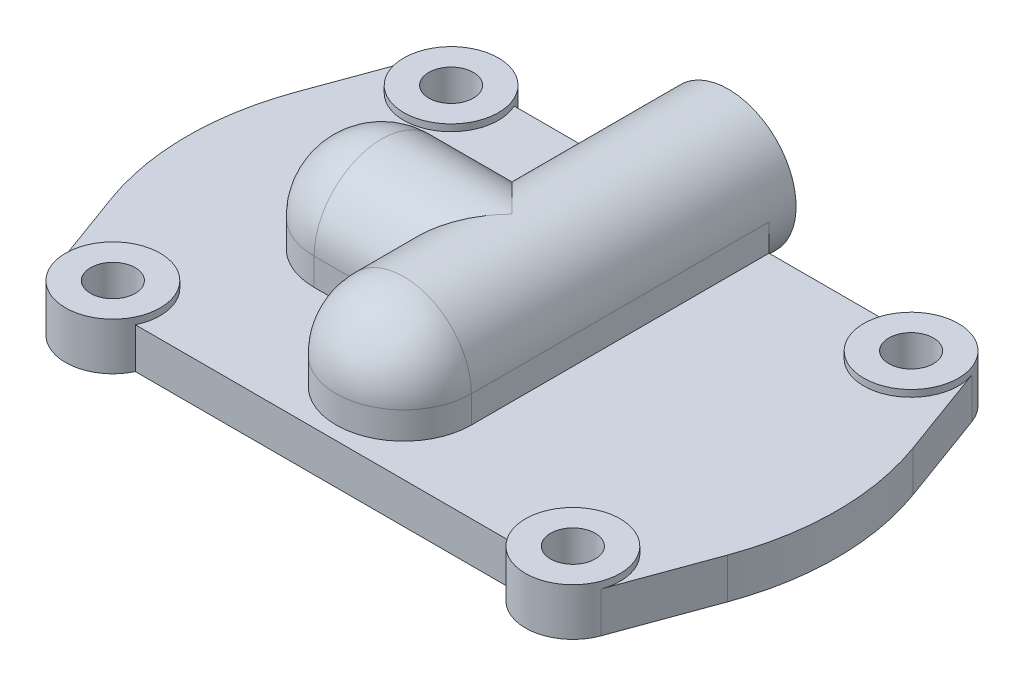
ISO-10303-21;
HEADER;
FILE_DESCRIPTION(('STEP AP214'),'2;1');
FILE_NAME('part.step','',(''),(''),'','','');
FILE_SCHEMA(('AUTOMOTIVE_DESIGN { 1 0 10303 214 1 1 1 1 }'));
ENDSEC;
DATA;
#1=APPLICATION_CONTEXT('core data for automotive mechanical design processes');
#2=APPLICATION_PROTOCOL_DEFINITION('international standard','automotive_design',2000,#1);
#3=PRODUCT_CONTEXT('',#1,'mechanical');
#4=PRODUCT('Part','Part','',(#3));
#5=PRODUCT_RELATED_PRODUCT_CATEGORY('part','',(#4));
#6=PRODUCT_DEFINITION_FORMATION('','',#4);
#7=PRODUCT_DEFINITION_CONTEXT('part definition',#1,'design');
#8=PRODUCT_DEFINITION('design','',#6,#7);
#9=PRODUCT_DEFINITION_SHAPE('','',#8);
#10=(LENGTH_UNIT() NAMED_UNIT(*) SI_UNIT(.MILLI.,.METRE.));
#11=(NAMED_UNIT(*) PLANE_ANGLE_UNIT() SI_UNIT($,.RADIAN.));
#12=(NAMED_UNIT(*) SI_UNIT($,.STERADIAN.) SOLID_ANGLE_UNIT());
#13=UNCERTAINTY_MEASURE_WITH_UNIT(LENGTH_MEASURE(1.E-05),#10,'distance_accuracy_value','');
#14=(GEOMETRIC_REPRESENTATION_CONTEXT(3) GLOBAL_UNCERTAINTY_ASSIGNED_CONTEXT((#13)) GLOBAL_UNIT_ASSIGNED_CONTEXT((#10,
#11,#12)) REPRESENTATION_CONTEXT('',''));
#15=CARTESIAN_POINT('',(0.,0.,0.));
#16=DIRECTION('',(0.,0.,1.));
#17=DIRECTION('',(1.,0.,0.));
#18=AXIS2_PLACEMENT_3D('',#15,#16,#17);
#19=CARTESIAN_POINT('',(-34.,0.,-25.));
#20=DIRECTION('',(0.,1.,0.));
#21=DIRECTION('',(0.,0.,1.));
#22=AXIS2_PLACEMENT_3D('',#19,#20,#21);
#23=PLANE('',#22);
#24=CARTESIAN_POINT('',(0.,0.,-16.));
#25=DIRECTION('',(0.,-1.,0.));
#26=DIRECTION('',(0.,0.,-1.));
#27=AXIS2_PLACEMENT_3D('',#24,#25,#26);
#28=CIRCLE('',#27,2.);
#29=CARTESIAN_POINT('',(0.,0.,-18.));
#30=VERTEX_POINT('',#29);
#31=EDGE_CURVE('E748',#30,#30,#28,.T.);
#32=ORIENTED_EDGE('',*,*,#31,.F.);
#33=EDGE_LOOP('',(#32));
#34=FACE_BOUND('',#33,.T.);
#35=CARTESIAN_POINT('',(-19.25,0.,0.));
#36=DIRECTION('',(0.,-1.,0.));
#37=DIRECTION('',(0.,0.,-1.));
#38=AXIS2_PLACEMENT_3D('',#35,#36,#37);
#39=CIRCLE('',#38,8.);
#40=CARTESIAN_POINT('',(-19.25,0.,-8.));
#41=VERTEX_POINT('',#40);
#42=EDGE_CURVE('E403',#41,#41,#39,.T.);
#43=ORIENTED_EDGE('',*,*,#42,.F.);
#44=EDGE_LOOP('',(#43));
#45=FACE_BOUND('',#44,.T.);
#46=CARTESIAN_POINT('',(34.,0.,25.));
#47=DIRECTION('',(0.,1.,0.));
#48=DIRECTION('',(0.,0.,-1.));
#49=AXIS2_PLACEMENT_3D('',#46,#47,#48);
#50=CIRCLE('',#49,3.3);
#51=CARTESIAN_POINT('',(34.,0.,21.7));
#52=VERTEX_POINT('',#51);
#53=EDGE_CURVE('E540',#52,#52,#50,.T.);
#54=ORIENTED_EDGE('',*,*,#53,.T.);
#55=EDGE_LOOP('',(#54));
#56=FACE_BOUND('',#55,.T.);
#57=CARTESIAN_POINT('',(-34.,0.,25.));
#58=DIRECTION('',(0.,1.,0.));
#59=DIRECTION('',(0.,0.,1.));
#60=AXIS2_PLACEMENT_3D('',#57,#58,#59);
#61=CIRCLE('',#60,3.3);
#62=CARTESIAN_POINT('',(-34.,0.,28.3));
#63=VERTEX_POINT('',#62);
#64=EDGE_CURVE('E546',#63,#63,#61,.T.);
#65=ORIENTED_EDGE('',*,*,#64,.T.);
#66=EDGE_LOOP('',(#65));
#67=FACE_BOUND('',#66,.T.);
#68=CARTESIAN_POINT('',(-34.,0.,-25.));
#69=DIRECTION('',(0.,1.,0.));
#70=DIRECTION('',(0.,0.,1.));
#71=AXIS2_PLACEMENT_3D('',#68,#69,#70);
#72=CIRCLE('',#71,7.);
#73=CARTESIAN_POINT('',(-27.6754446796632,0.,-28.));
#74=VERTEX_POINT('',#73);
#75=CARTESIAN_POINT('',(-40.5749719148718,0.,-27.4020292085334));
#76=VERTEX_POINT('',#75);
#77=EDGE_CURVE('E290',#74,#76,#72,.T.);
#78=ORIENTED_EDGE('',*,*,#77,.F.);
#79=DIRECTION('',(-1.,0.,0.));
#80=VECTOR('',#79,1.);
#81=CARTESIAN_POINT('',(-27.6754446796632,0.,-28.));
#82=LINE('',#81,#80);
#83=CARTESIAN_POINT('',(0.,-1.52655665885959E-13,-28.));
#84=VERTEX_POINT('',#83);
#85=EDGE_CURVE('E319',#84,#74,#82,.T.);
#86=ORIENTED_EDGE('',*,*,#85,.F.);
#87=CARTESIAN_POINT('',(27.6754446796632,0.,-28.));
#88=VERTEX_POINT('',#87);
#89=EDGE_CURVE('E320',#88,#84,#82,.T.);
#90=ORIENTED_EDGE('',*,*,#89,.F.);
#91=CARTESIAN_POINT('',(34.,0.,-25.));
#92=DIRECTION('',(0.,1.,0.));
#93=DIRECTION('',(0.,0.,-1.));
#94=AXIS2_PLACEMENT_3D('',#91,#92,#93);
#95=CIRCLE('',#94,7.);
#96=CARTESIAN_POINT('',(40.5749719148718,0.,-27.4020292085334));
#97=VERTEX_POINT('',#96);
#98=EDGE_CURVE('E317',#97,#88,#95,.T.);
#99=ORIENTED_EDGE('',*,*,#98,.F.);
#100=DIRECTION('',(-0.343147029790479,0.,-0.939281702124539));
#101=VECTOR('',#100,1.);
#102=CARTESIAN_POINT('',(40.5749719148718,0.,-27.4020292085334));
#103=LINE('',#102,#101);
#104=CARTESIAN_POINT('',(45.5712680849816,0.,-13.7258811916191));
#105=VERTEX_POINT('',#104);
#106=EDGE_CURVE('E315',#105,#97,#103,.T.);
#107=ORIENTED_EDGE('',*,*,#106,.F.);
#108=CARTESIAN_POINT('',(8.,0.,0.));
#109=DIRECTION('',(0.,1.,0.));
#110=DIRECTION('',(0.,0.,1.));
#111=AXIS2_PLACEMENT_3D('',#108,#109,#110);
#112=CIRCLE('',#111,40.);
#113=CARTESIAN_POINT('',(45.5712680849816,0.,13.7258811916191));
#114=VERTEX_POINT('',#113);
#115=EDGE_CURVE('E313',#114,#105,#112,.T.);
#116=ORIENTED_EDGE('',*,*,#115,.F.);
#117=DIRECTION('',(0.343147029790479,0.,-0.939281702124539));
#118=VECTOR('',#117,1.);
#119=CARTESIAN_POINT('',(40.5749719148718,0.,27.4020292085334));
#120=LINE('',#119,#118);
#121=CARTESIAN_POINT('',(40.5749719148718,0.,27.4020292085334));
#122=VERTEX_POINT('',#121);
#123=EDGE_CURVE('E311',#122,#114,#120,.T.);
#124=ORIENTED_EDGE('',*,*,#123,.F.);
#125=CARTESIAN_POINT('',(34.,0.,25.));
#126=DIRECTION('',(0.,1.,0.));
#127=DIRECTION('',(0.,0.,1.));
#128=AXIS2_PLACEMENT_3D('',#125,#126,#127);
#129=CIRCLE('',#128,6.99999999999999);
#130=CARTESIAN_POINT('',(27.6754446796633,0.,28.));
#131=VERTEX_POINT('',#130);
#132=EDGE_CURVE('E309',#131,#122,#129,.T.);
#133=ORIENTED_EDGE('',*,*,#132,.F.);
#134=DIRECTION('',(1.,0.,0.));
#135=VECTOR('',#134,1.);
#136=CARTESIAN_POINT('',(-27.6754446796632,0.,28.));
#137=LINE('',#136,#135);
#138=CARTESIAN_POINT('',(-27.6754446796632,0.,28.));
#139=VERTEX_POINT('',#138);
#140=EDGE_CURVE('E307',#139,#131,#137,.T.);
#141=ORIENTED_EDGE('',*,*,#140,.F.);
#142=CARTESIAN_POINT('',(-34.,0.,25.));
#143=DIRECTION('',(0.,1.,0.));
#144=DIRECTION('',(0.,0.,-1.));
#145=AXIS2_PLACEMENT_3D('',#142,#143,#144);
#146=CIRCLE('',#145,7.);
#147=CARTESIAN_POINT('',(-40.5749719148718,0.,27.4020292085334));
#148=VERTEX_POINT('',#147);
#149=EDGE_CURVE('E302',#148,#139,#146,.T.);
#150=ORIENTED_EDGE('',*,*,#149,.F.);
#151=DIRECTION('',(0.343147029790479,0.,0.939281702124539));
#152=VECTOR('',#151,1.);
#153=CARTESIAN_POINT('',(-40.5749719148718,0.,27.4020292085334));
#154=LINE('',#153,#152);
#155=CARTESIAN_POINT('',(-45.5712680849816,0.,13.7258811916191));
#156=VERTEX_POINT('',#155);
#157=EDGE_CURVE('E300',#156,#148,#154,.T.);
#158=ORIENTED_EDGE('',*,*,#157,.F.);
#159=CARTESIAN_POINT('',(-8.,0.,0.));
#160=DIRECTION('',(0.,1.,0.));
#161=DIRECTION('',(0.,0.,1.));
#162=AXIS2_PLACEMENT_3D('',#159,#160,#161);
#163=CIRCLE('',#162,40.);
#164=CARTESIAN_POINT('',(-45.5712680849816,0.,-13.7258811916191));
#165=VERTEX_POINT('',#164);
#166=EDGE_CURVE('E289',#165,#156,#163,.T.);
#167=ORIENTED_EDGE('',*,*,#166,.F.);
#168=DIRECTION('',(-0.343147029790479,0.,0.939281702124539));
#169=VECTOR('',#168,1.);
#170=CARTESIAN_POINT('',(-40.5749719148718,0.,-27.4020292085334));
#171=LINE('',#170,#169);
#172=EDGE_CURVE('E278',#76,#165,#171,.T.);
#173=ORIENTED_EDGE('',*,*,#172,.F.);
#174=EDGE_LOOP('',(#78,#86,#90,#99,#107,#116,#124,#133,#141,#150,#158,#167,#173));
#175=FACE_BOUND('',#174,.T.);
#176=CARTESIAN_POINT('',(-34.,0.,-25.));
#177=DIRECTION('',(0.,1.,0.));
#178=DIRECTION('',(0.,0.,-1.));
#179=AXIS2_PLACEMENT_3D('',#176,#177,#178);
#180=CIRCLE('',#179,3.3);
#181=CARTESIAN_POINT('',(-34.,0.,-28.3));
#182=VERTEX_POINT('',#181);
#183=EDGE_CURVE('E543',#182,#182,#180,.T.);
#184=ORIENTED_EDGE('',*,*,#183,.T.);
#185=EDGE_LOOP('',(#184));
#186=FACE_BOUND('',#185,.T.);
#187=CARTESIAN_POINT('',(34.,0.,-25.));
#188=DIRECTION('',(0.,1.,0.));
#189=DIRECTION('',(0.,0.,1.));
#190=AXIS2_PLACEMENT_3D('',#187,#188,#189);
#191=CIRCLE('',#190,3.3);
#192=CARTESIAN_POINT('',(34.,0.,-21.7));
#193=VERTEX_POINT('',#192);
#194=EDGE_CURVE('E537',#193,#193,#191,.T.);
#195=ORIENTED_EDGE('',*,*,#194,.T.);
#196=EDGE_LOOP('',(#195));
#197=FACE_BOUND('',#196,.T.);
#198=CARTESIAN_POINT('',(0.,0.,16.));
#199=DIRECTION('',(0.,-1.,0.));
#200=DIRECTION('',(0.,0.,-1.));
#201=AXIS2_PLACEMENT_3D('',#198,#199,#200);
#202=CIRCLE('',#201,1.99999999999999);
#203=CARTESIAN_POINT('',(0.,0.,14.));
#204=VERTEX_POINT('',#203);
#205=EDGE_CURVE('E707',#204,#204,#202,.T.);
#206=ORIENTED_EDGE('',*,*,#205,.F.);
#207=EDGE_LOOP('',(#206));
#208=FACE_BOUND('',#207,.T.);
#209=ADVANCED_FACE('F27',(#34,#45,#56,#67,#175,#186,#197,#208),#23,.F.);
#210=CARTESIAN_POINT('',(0.,10.,-33.5692116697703));
#211=DIRECTION('',(0.,0.,-1.));
#212=DIRECTION('',(0.,1.,0.));
#213=AXIS2_PLACEMENT_3D('',#210,#211,#212);
#214=CYLINDRICAL_SURFACE('',#213,2.);
#215=CARTESIAN_POINT('',(0.,9.99999999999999,-5.58058436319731));
#216=DIRECTION('',(0.,0.,-1.));
#217=DIRECTION('',(0.,1.,0.));
#218=AXIS2_PLACEMENT_3D('',#215,#216,#217);
#219=CIRCLE('',#218,2.);
#220=CARTESIAN_POINT('',(0.,12.,-5.58058436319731));
#221=VERTEX_POINT('',#220);
#222=EDGE_CURVE('E423',#221,#221,#219,.T.);
#223=ORIENTED_EDGE('',*,*,#222,.T.);
#224=EDGE_LOOP('',(#223));
#225=FACE_BOUND('',#224,.T.);
#226=CARTESIAN_POINT('',(0.,9.99999999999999,16.));
#227=DIRECTION('',(0.,-0.707106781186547,-0.707106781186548));
#228=DIRECTION('',(0.,0.707106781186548,-0.707106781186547));
#229=AXIS2_PLACEMENT_3D('',#226,#227,#228);
#230=ELLIPSE('',#229,2.82842712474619,2.);
#231=CARTESIAN_POINT('',(-1.63299316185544,11.1547005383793,14.8452994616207));
#232=VERTEX_POINT('',#231);
#233=CARTESIAN_POINT('',(1.63299316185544,11.1547005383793,14.8452994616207));
#234=VERTEX_POINT('',#233);
#235=EDGE_CURVE('E412',#232,#234,#230,.T.);
#236=ORIENTED_EDGE('',*,*,#235,.F.);
#237=CARTESIAN_POINT('',(0.,9.99999999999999,14.8452994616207));
#238=DIRECTION('',(0.,0.,-1.));
#239=DIRECTION('',(0.,1.,0.));
#240=AXIS2_PLACEMENT_3D('',#237,#238,#239);
#241=CIRCLE('',#240,2.);
#242=CARTESIAN_POINT('',(-1.63299316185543,8.84529946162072,14.8452994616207));
#243=VERTEX_POINT('',#242);
#244=EDGE_CURVE('E407',#243,#232,#241,.T.);
#245=ORIENTED_EDGE('',*,*,#244,.F.);
#246=CARTESIAN_POINT('',(0.,9.99999999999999,16.));
#247=DIRECTION('',(0.,0.707106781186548,-0.707106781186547));
#248=DIRECTION('',(0.,-0.707106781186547,-0.707106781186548));
#249=AXIS2_PLACEMENT_3D('',#246,#247,#248);
#250=ELLIPSE('',#249,2.82842712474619,2.);
#251=CARTESIAN_POINT('',(1.63299316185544,8.84529946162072,14.8452994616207));
#252=VERTEX_POINT('',#251);
#253=EDGE_CURVE('E46',#252,#243,#250,.T.);
#254=ORIENTED_EDGE('',*,*,#253,.F.);
#255=EDGE_CURVE('E410',#234,#252,#241,.T.);
#256=ORIENTED_EDGE('',*,*,#255,.F.);
#257=EDGE_LOOP('',(#236,#245,#254,#256));
#258=FACE_BOUND('',#257,.T.);
#259=ADVANCED_FACE('F207',(#225,#258),#214,.F.);
#260=CARTESIAN_POINT('',(0.,9.99999999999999,14.8452994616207));
#261=DIRECTION('',(0.,0.,-1.));
#262=DIRECTION('',(0.,1.,0.));
#263=AXIS2_PLACEMENT_3D('',#260,#261,#262);
#264=CONICAL_SURFACE('',#263,2.,1.04719755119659);
#265=CARTESIAN_POINT('',(1.63285172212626,11.155500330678,14.8450994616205));
#266=CARTESIAN_POINT('',(1.65205657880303,11.046865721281,14.8722945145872));
#267=CARTESIAN_POINT('',(1.668461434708,10.9369789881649,14.8968959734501));
#268=CARTESIAN_POINT('',(1.6957223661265,10.7150106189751,14.9392492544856));
#269=CARTESIAN_POINT('',(1.70656780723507,10.602925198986,14.9569879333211));
#270=CARTESIAN_POINT('',(1.72246461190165,10.3804150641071,14.9834642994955));
#271=CARTESIAN_POINT('',(1.72766829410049,10.2700304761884,14.9924379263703));
#272=CARTESIAN_POINT('',(1.73276151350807,10.048877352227,15.0012157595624));
#273=CARTESIAN_POINT('',(1.73265685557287,9.93810936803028,15.0010299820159));
#274=CARTESIAN_POINT('',(1.72784997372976,9.74510943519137,14.9927546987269));
#275=CARTESIAN_POINT('',(1.72431830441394,9.66275199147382,14.9866778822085));
#276=CARTESIAN_POINT('',(1.71431393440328,9.4986579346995,14.9698426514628));
#277=CARTESIAN_POINT('',(1.7078397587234,9.41692165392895,14.9590818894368));
#278=CARTESIAN_POINT('',(1.69179162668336,9.25265386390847,14.9331926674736));
#279=CARTESIAN_POINT('',(1.68215423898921,9.17014282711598,14.9179755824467));
#280=CARTESIAN_POINT('',(1.65980970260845,9.00636926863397,14.8840078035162));
#281=CARTESIAN_POINT('',(1.6471061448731,8.92510540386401,14.8652612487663));
#282=CARTESIAN_POINT('',(1.63285172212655,8.84449966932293,14.8450994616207));
#283=B_SPLINE_CURVE_WITH_KNOTS('',3,(#265,#266,#267,#268,#269,#270,#271,#272,#273,#274,#275,
#276,#277,#278,#279,#280,#281,#282),.UNSPECIFIED.,.F.,.F.,(4,2,2,2,2,2,2,2,4),(0.,
0.340954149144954,0.682558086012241,1.01469010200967,1.34645892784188,1.59424234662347,
1.84215010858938,2.09536844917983,2.34829165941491),.UNSPECIFIED.);
#284=EDGE_CURVE('E11',#234,#252,#283,.T.);
#285=ORIENTED_EDGE('',*,*,#284,.F.);
#286=ORIENTED_EDGE('',*,*,#255,.T.);
#287=EDGE_LOOP('',(#285,#286));
#288=FACE_BOUND('',#287,.T.);
#289=ADVANCED_FACE('F214',(#288),#264,.F.);
#290=CARTESIAN_POINT('',(-1.63285172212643,8.84449966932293,14.8450994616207));
#291=CARTESIAN_POINT('',(-1.65205657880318,8.95313427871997,14.8722945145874));
#292=CARTESIAN_POINT('',(-1.66846143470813,9.06302101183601,14.8968959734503));
#293=CARTESIAN_POINT('',(-1.69572236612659,9.28498938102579,14.9392492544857));
#294=CARTESIAN_POINT('',(-1.70656780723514,9.39707480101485,14.9569879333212));
#295=CARTESIAN_POINT('',(-1.7224646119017,9.61958493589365,14.9834642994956));
#296=CARTESIAN_POINT('',(-1.72766829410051,9.72996952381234,14.9924379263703));
#297=CARTESIAN_POINT('',(-1.73276151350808,9.95112264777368,15.0012157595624));
#298=CARTESIAN_POINT('',(-1.73265685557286,10.0618906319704,15.0010299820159));
#299=CARTESIAN_POINT('',(-1.72784997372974,10.2548905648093,14.9927546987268));
#300=CARTESIAN_POINT('',(-1.7243183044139,10.3372480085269,14.9866778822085));
#301=CARTESIAN_POINT('',(-1.71431393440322,10.5013420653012,14.9698426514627));
#302=CARTESIAN_POINT('',(-1.70783975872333,10.5830783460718,14.9590818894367));
#303=CARTESIAN_POINT('',(-1.69179162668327,10.7473461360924,14.9331926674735));
#304=CARTESIAN_POINT('',(-1.6821542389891,10.8298571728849,14.9179755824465));
#305=CARTESIAN_POINT('',(-1.65980970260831,10.9936307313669,14.884007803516));
#306=CARTESIAN_POINT('',(-1.64710614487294,11.0748945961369,14.8652612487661));
#307=CARTESIAN_POINT('',(-1.63285172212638,11.155500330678,14.8450994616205));
#308=B_SPLINE_CURVE_WITH_KNOTS('',3,(#290,#291,#292,#293,#294,#295,#296,#297,#298,#299,#300,
#301,#302,#303,#304,#305,#306,#307),.UNSPECIFIED.,.F.,.F.,(4,2,2,2,2,2,2,2,4),(0.,
0.340954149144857,0.682558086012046,1.01469010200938,1.3464589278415,1.59424234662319,
1.84215010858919,2.09536844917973,2.34829165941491),.UNSPECIFIED.);
#309=EDGE_CURVE('E40',#243,#232,#308,.T.);
#310=ORIENTED_EDGE('',*,*,#309,.F.);
#311=ORIENTED_EDGE('',*,*,#244,.T.);
#312=EDGE_LOOP('',(#310,#311));
#313=FACE_BOUND('',#312,.T.);
#314=ADVANCED_FACE('F615',(#313),#264,.F.);
#315=CARTESIAN_POINT('',(0.,9.99999999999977,-50.3606797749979));
#316=DIRECTION('',(0.,0.,1.));
#317=DIRECTION('',(0.,-1.,0.));
#318=AXIS2_PLACEMENT_3D('',#315,#316,#317);
#319=CYLINDRICAL_SURFACE('',#318,10.);
#320=CARTESIAN_POINT('',(0.,9.99999999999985,-32.));
#321=DIRECTION('',(0.,0.,-1.));
#322=DIRECTION('',(-1.,0.,0.));
#323=AXIS2_PLACEMENT_3D('',#320,#321,#322);
#324=CIRCLE('',#323,10.);
#325=CARTESIAN_POINT('',(-10.,9.99999999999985,-32.));
#326=VERTEX_POINT('',#325);
#327=EDGE_CURVE('E435',#326,#326,#324,.T.);
#328=ORIENTED_EDGE('',*,*,#327,.F.);
#329=EDGE_LOOP('',(#328));
#330=FACE_BOUND('',#329,.T.);
#331=CARTESIAN_POINT('',(0.,9.99999999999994,0.));
#332=DIRECTION('',(-0.707106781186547,0.,0.707106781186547));
#333=DIRECTION('',(-0.707106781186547,0.,-0.707106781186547));
#334=AXIS2_PLACEMENT_3D('',#331,#332,#333);
#335=ELLIPSE('',#334,14.142135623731,10.);
#336=CARTESIAN_POINT('',(-10.,10.,-10.));
#337=VERTEX_POINT('',#336);
#338=CARTESIAN_POINT('',(0.,19.9999999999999,0.));
#339=VERTEX_POINT('',#338);
#340=EDGE_CURVE('E54',#337,#339,#335,.F.);
#341=ORIENTED_EDGE('',*,*,#340,.T.);
#342=CARTESIAN_POINT('',(0.,9.99999999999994,0.));
#343=DIRECTION('',(-0.707106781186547,0.,-0.707106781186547));
#344=DIRECTION('',(-0.707106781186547,0.,0.707106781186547));
#345=AXIS2_PLACEMENT_3D('',#342,#343,#344);
#346=ELLIPSE('',#345,14.142135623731,10.);
#347=CARTESIAN_POINT('',(-10.,10.,9.99999999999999));
#348=VERTEX_POINT('',#347);
#349=EDGE_CURVE('E427',#339,#348,#346,.F.);
#350=ORIENTED_EDGE('',*,*,#349,.T.);
#351=DIRECTION('',(0.,0.,1.));
#352=VECTOR('',#351,1.);
#353=CARTESIAN_POINT('',(-10.,10.,9.99999999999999));
#354=LINE('',#353,#352);
#355=CARTESIAN_POINT('',(-10.,10.,16.));
#356=VERTEX_POINT('',#355);
#357=EDGE_CURVE('E472',#348,#356,#354,.T.);
#358=ORIENTED_EDGE('',*,*,#357,.T.);
#359=CARTESIAN_POINT('',(0.,10.,16.));
#360=DIRECTION('',(0.,0.,-1.));
#361=DIRECTION('',(0.,1.,0.));
#362=AXIS2_PLACEMENT_3D('',#359,#360,#361);
#363=CIRCLE('',#362,10.);
#364=CARTESIAN_POINT('',(10.,10.,16.));
#365=VERTEX_POINT('',#364);
#366=EDGE_CURVE('E438',#356,#365,#363,.T.);
#367=ORIENTED_EDGE('',*,*,#366,.T.);
#368=DIRECTION('',(0.,0.,-1.));
#369=VECTOR('',#368,1.);
#370=CARTESIAN_POINT('',(10.,10.,-28.));
#371=LINE('',#370,#369);
#372=CARTESIAN_POINT('',(10.,10.,-28.));
#373=VERTEX_POINT('',#372);
#374=EDGE_CURVE('E477',#365,#373,#371,.T.);
#375=ORIENTED_EDGE('',*,*,#374,.T.);
#376=CARTESIAN_POINT('',(0.,9.99999999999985,-28.));
#377=DIRECTION('',(0.,0.,-1.));
#378=DIRECTION('',(-1.,0.,0.));
#379=AXIS2_PLACEMENT_3D('',#376,#377,#378);
#380=CIRCLE('',#379,10.);
#381=EDGE_CURVE('E434',#373,#84,#380,.T.);
#382=ORIENTED_EDGE('',*,*,#381,.T.);
#383=CARTESIAN_POINT('',(-10.,10.,-28.));
#384=VERTEX_POINT('',#383);
#385=EDGE_CURVE('E432',#84,#384,#380,.T.);
#386=ORIENTED_EDGE('',*,*,#385,.T.);
#387=DIRECTION('',(0.,0.,1.));
#388=VECTOR('',#387,1.);
#389=CARTESIAN_POINT('',(-10.,10.,-28.));
#390=LINE('',#389,#388);
#391=EDGE_CURVE('E462',#384,#337,#390,.T.);
#392=ORIENTED_EDGE('',*,*,#391,.T.);
#393=EDGE_LOOP('',(#341,#350,#358,#367,#375,#382,#386,#392));
#394=FACE_BOUND('',#393,.T.);
#395=ADVANCED_FACE('F231',(#330,#394),#319,.T.);
#396=CARTESIAN_POINT('',(-27.6754446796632,6.,-28.));
#397=DIRECTION('',(0.,0.,1.));
#398=DIRECTION('',(1.,0.,0.));
#399=AXIS2_PLACEMENT_3D('',#396,#397,#398);
#400=PLANE('',#399);
#401=ORIENTED_EDGE('',*,*,#381,.F.);
#402=DIRECTION('',(0.,-1.,0.));
#403=VECTOR('',#402,1.);
#404=CARTESIAN_POINT('',(10.,10.,-28.));
#405=LINE('',#404,#403);
#406=CARTESIAN_POINT('',(10.,6.,-28.));
#407=VERTEX_POINT('',#406);
#408=EDGE_CURVE('E480',#373,#407,#405,.T.);
#409=ORIENTED_EDGE('',*,*,#408,.T.);
#410=DIRECTION('',(-1.,0.,0.));
#411=VECTOR('',#410,1.);
#412=CARTESIAN_POINT('',(-27.6754446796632,6.,-28.));
#413=LINE('',#412,#411);
#414=CARTESIAN_POINT('',(27.6754446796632,6.,-28.));
#415=VERTEX_POINT('',#414);
#416=EDGE_CURVE('E378',#415,#407,#413,.T.);
#417=ORIENTED_EDGE('',*,*,#416,.F.);
#418=DIRECTION('',(0.,-1.,0.));
#419=VECTOR('',#418,1.);
#420=CARTESIAN_POINT('',(27.6754446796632,6.,-28.));
#421=LINE('',#420,#419);
#422=EDGE_CURVE('E336',#415,#88,#421,.T.);
#423=ORIENTED_EDGE('',*,*,#422,.T.);
#424=ORIENTED_EDGE('',*,*,#89,.T.);
#425=EDGE_LOOP('',(#401,#409,#417,#423,#424));
#426=FACE_BOUND('',#425,.T.);
#427=ADVANCED_FACE('F228',(#426),#400,.F.);
#428=ORIENTED_EDGE('',*,*,#385,.F.);
#429=ORIENTED_EDGE('',*,*,#85,.T.);
#430=DIRECTION('',(0.,-1.,0.));
#431=VECTOR('',#430,1.);
#432=CARTESIAN_POINT('',(-27.6754446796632,6.,-28.));
#433=LINE('',#432,#431);
#434=CARTESIAN_POINT('',(-27.6754446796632,6.,-28.));
#435=VERTEX_POINT('',#434);
#436=EDGE_CURVE('E340',#435,#74,#433,.T.);
#437=ORIENTED_EDGE('',*,*,#436,.F.);
#438=CARTESIAN_POINT('',(-10.,6.,-28.));
#439=VERTEX_POINT('',#438);
#440=EDGE_CURVE('E335',#439,#435,#413,.T.);
#441=ORIENTED_EDGE('',*,*,#440,.F.);
#442=DIRECTION('',(0.,-1.,0.));
#443=VECTOR('',#442,1.);
#444=CARTESIAN_POINT('',(-10.,10.,-28.));
#445=LINE('',#444,#443);
#446=EDGE_CURVE('E501',#384,#439,#445,.T.);
#447=ORIENTED_EDGE('',*,*,#446,.F.);
#448=EDGE_LOOP('',(#428,#429,#437,#441,#447));
#449=FACE_BOUND('',#448,.T.);
#450=ADVANCED_FACE('F226',(#449),#400,.F.);
#451=CARTESIAN_POINT('',(-34.,6.,-25.));
#452=DIRECTION('',(0.,1.,0.));
#453=DIRECTION('',(0.,0.,1.));
#454=AXIS2_PLACEMENT_3D('',#451,#452,#453);
#455=PLANE('',#454);
#456=DIRECTION('',(-1.,0.,0.));
#457=VECTOR('',#456,1.);
#458=CARTESIAN_POINT('',(-10.,6.,-10.));
#459=LINE('',#458,#457);
#460=CARTESIAN_POINT('',(-10.,6.,-10.));
#461=VERTEX_POINT('',#460);
#462=CARTESIAN_POINT('',(-19.25,6.,-10.));
#463=VERTEX_POINT('',#462);
#464=EDGE_CURVE('E444',#461,#463,#459,.T.);
#465=ORIENTED_EDGE('',*,*,#464,.F.);
#466=DIRECTION('',(0.,0.,1.));
#467=VECTOR('',#466,1.);
#468=CARTESIAN_POINT('',(-10.,6.,-28.));
#469=LINE('',#468,#467);
#470=EDGE_CURVE('E441',#439,#461,#469,.T.);
#471=ORIENTED_EDGE('',*,*,#470,.F.);
#472=ORIENTED_EDGE('',*,*,#440,.T.);
#473=CARTESIAN_POINT('',(-34.,6.,-25.));
#474=DIRECTION('',(0.,1.,0.));
#475=DIRECTION('',(0.,0.,1.));
#476=AXIS2_PLACEMENT_3D('',#473,#474,#475);
#477=CIRCLE('',#476,7.);
#478=CARTESIAN_POINT('',(-40.5749719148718,6.,-27.4020292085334));
#479=VERTEX_POINT('',#478);
#480=EDGE_CURVE('E366',#479,#435,#477,.T.);
#481=ORIENTED_EDGE('',*,*,#480,.F.);
#482=DIRECTION('',(-0.343147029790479,0.,0.939281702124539));
#483=VECTOR('',#482,1.);
#484=CARTESIAN_POINT('',(-40.5749719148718,6.,-27.4020292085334));
#485=LINE('',#484,#483);
#486=CARTESIAN_POINT('',(-45.5712680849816,6.,-13.7258811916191));
#487=VERTEX_POINT('',#486);
#488=EDGE_CURVE('E323',#479,#487,#485,.T.);
#489=ORIENTED_EDGE('',*,*,#488,.T.);
#490=CARTESIAN_POINT('',(-8.,6.,0.));
#491=DIRECTION('',(0.,1.,0.));
#492=DIRECTION('',(0.,0.,1.));
#493=AXIS2_PLACEMENT_3D('',#490,#491,#492);
#494=CIRCLE('',#493,40.);
#495=CARTESIAN_POINT('',(-45.5712680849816,6.,13.7258811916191));
#496=VERTEX_POINT('',#495);
#497=EDGE_CURVE('E294',#487,#496,#494,.T.);
#498=ORIENTED_EDGE('',*,*,#497,.T.);
#499=DIRECTION('',(0.343147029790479,0.,0.939281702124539));
#500=VECTOR('',#499,1.);
#501=CARTESIAN_POINT('',(-40.5749719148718,6.,27.4020292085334));
#502=LINE('',#501,#500);
#503=CARTESIAN_POINT('',(-40.5749719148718,6.,27.4020292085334));
#504=VERTEX_POINT('',#503);
#505=EDGE_CURVE('E325',#496,#504,#502,.T.);
#506=ORIENTED_EDGE('',*,*,#505,.T.);
#507=CARTESIAN_POINT('',(-34.,6.,25.));
#508=DIRECTION('',(0.,1.,0.));
#509=DIRECTION('',(0.,0.,1.));
#510=AXIS2_PLACEMENT_3D('',#507,#508,#509);
#511=CIRCLE('',#510,7.);
#512=CARTESIAN_POINT('',(-27.6754446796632,6.,28.));
#513=VERTEX_POINT('',#512);
#514=EDGE_CURVE('E507',#513,#504,#511,.T.);
#515=ORIENTED_EDGE('',*,*,#514,.F.);
#516=DIRECTION('',(1.,0.,0.));
#517=VECTOR('',#516,1.);
#518=CARTESIAN_POINT('',(-27.6754446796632,6.,28.));
#519=LINE('',#518,#517);
#520=CARTESIAN_POINT('',(27.6754446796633,6.,28.));
#521=VERTEX_POINT('',#520);
#522=EDGE_CURVE('E327',#513,#521,#519,.T.);
#523=ORIENTED_EDGE('',*,*,#522,.T.);
#524=CARTESIAN_POINT('',(34.,6.,25.));
#525=DIRECTION('',(0.,1.,0.));
#526=DIRECTION('',(0.,0.,1.));
#527=AXIS2_PLACEMENT_3D('',#524,#525,#526);
#528=CIRCLE('',#527,6.99999999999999);
#529=CARTESIAN_POINT('',(40.5749719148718,6.,27.4020292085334));
#530=VERTEX_POINT('',#529);
#531=EDGE_CURVE('E516',#530,#521,#528,.T.);
#532=ORIENTED_EDGE('',*,*,#531,.F.);
#533=DIRECTION('',(0.343147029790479,0.,-0.939281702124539));
#534=VECTOR('',#533,1.);
#535=CARTESIAN_POINT('',(40.5749719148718,6.,27.4020292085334));
#536=LINE('',#535,#534);
#537=CARTESIAN_POINT('',(45.5712680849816,6.,13.7258811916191));
#538=VERTEX_POINT('',#537);
#539=EDGE_CURVE('E329',#530,#538,#536,.T.);
#540=ORIENTED_EDGE('',*,*,#539,.T.);
#541=CARTESIAN_POINT('',(8.,6.,0.));
#542=DIRECTION('',(0.,1.,0.));
#543=DIRECTION('',(0.,0.,1.));
#544=AXIS2_PLACEMENT_3D('',#541,#542,#543);
#545=CIRCLE('',#544,40.);
#546=CARTESIAN_POINT('',(45.5712680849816,6.,-13.7258811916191));
#547=VERTEX_POINT('',#546);
#548=EDGE_CURVE('E331',#538,#547,#545,.T.);
#549=ORIENTED_EDGE('',*,*,#548,.T.);
#550=DIRECTION('',(-0.343147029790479,0.,-0.939281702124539));
#551=VECTOR('',#550,1.);
#552=CARTESIAN_POINT('',(40.5749719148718,6.,-27.4020292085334));
#553=LINE('',#552,#551);
#554=CARTESIAN_POINT('',(40.5749719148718,6.,-27.4020292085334));
#555=VERTEX_POINT('',#554);
#556=EDGE_CURVE('E333',#547,#555,#553,.T.);
#557=ORIENTED_EDGE('',*,*,#556,.T.);
#558=CARTESIAN_POINT('',(34.,6.,-25.));
#559=DIRECTION('',(0.,1.,0.));
#560=DIRECTION('',(0.,0.,1.));
#561=AXIS2_PLACEMENT_3D('',#558,#559,#560);
#562=CIRCLE('',#561,7.);
#563=EDGE_CURVE('E525',#415,#555,#562,.T.);
#564=ORIENTED_EDGE('',*,*,#563,.F.);
#565=ORIENTED_EDGE('',*,*,#416,.T.);
#566=DIRECTION('',(0.,0.,-1.));
#567=VECTOR('',#566,1.);
#568=CARTESIAN_POINT('',(10.,6.,-28.));
#569=LINE('',#568,#567);
#570=CARTESIAN_POINT('',(10.,6.,16.));
#571=VERTEX_POINT('',#570);
#572=EDGE_CURVE('E459',#571,#407,#569,.T.);
#573=ORIENTED_EDGE('',*,*,#572,.F.);
#574=CARTESIAN_POINT('',(0.,6.,16.));
#575=DIRECTION('',(0.,1.,0.));
#576=DIRECTION('',(0.,0.,1.));
#577=AXIS2_PLACEMENT_3D('',#574,#575,#576);
#578=CIRCLE('',#577,10.);
#579=CARTESIAN_POINT('',(-10.,6.,16.));
#580=VERTEX_POINT('',#579);
#581=EDGE_CURVE('E456',#580,#571,#578,.T.);
#582=ORIENTED_EDGE('',*,*,#581,.F.);
#583=DIRECTION('',(0.,0.,1.));
#584=VECTOR('',#583,1.);
#585=CARTESIAN_POINT('',(-10.,6.,9.99999999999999));
#586=LINE('',#585,#584);
#587=CARTESIAN_POINT('',(-10.,6.,10.));
#588=VERTEX_POINT('',#587);
#589=EDGE_CURVE('E453',#588,#580,#586,.T.);
#590=ORIENTED_EDGE('',*,*,#589,.F.);
#591=DIRECTION('',(1.,0.,0.));
#592=VECTOR('',#591,1.);
#593=CARTESIAN_POINT('',(-10.,6.,9.99999999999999));
#594=LINE('',#593,#592);
#595=CARTESIAN_POINT('',(-19.25,6.,10.));
#596=VERTEX_POINT('',#595);
#597=EDGE_CURVE('E450',#596,#588,#594,.T.);
#598=ORIENTED_EDGE('',*,*,#597,.F.);
#599=CARTESIAN_POINT('',(-19.25,6.,0.));
#600=DIRECTION('',(0.,1.,0.));
#601=DIRECTION('',(0.,0.,1.));
#602=AXIS2_PLACEMENT_3D('',#599,#600,#601);
#603=CIRCLE('',#602,10.);
#604=EDGE_CURVE('E447',#463,#596,#603,.T.);
#605=ORIENTED_EDGE('',*,*,#604,.F.);
#606=EDGE_LOOP('',(#465,#471,#472,#481,#489,#498,#506,#515,#523,#532,#540,#549,#557,#564,#565,
#573,#582,#590,#598,#605));
#607=FACE_BOUND('',#606,.T.);
#608=ADVANCED_FACE('F223',(#607),#455,.T.);
#609=CARTESIAN_POINT('',(-34.,6.,-25.));
#610=DIRECTION('',(0.,-1.,0.));
#611=DIRECTION('',(0.,0.,-1.));
#612=AXIS2_PLACEMENT_3D('',#609,#610,#611);
#613=CYLINDRICAL_SURFACE('',#612,7.);
#614=ORIENTED_EDGE('',*,*,#77,.T.);
#615=DIRECTION('',(0.,-1.,0.));
#616=VECTOR('',#615,1.);
#617=CARTESIAN_POINT('',(-40.5749719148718,6.,-27.4020292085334));
#618=LINE('',#617,#616);
#619=EDGE_CURVE('E284',#479,#76,#618,.T.);
#620=ORIENTED_EDGE('',*,*,#619,.F.);
#621=ORIENTED_EDGE('',*,*,#480,.T.);
#622=ORIENTED_EDGE('',*,*,#436,.T.);
#623=EDGE_LOOP('',(#614,#620,#621,#622));
#624=FACE_BOUND('',#623,.T.);
#625=CARTESIAN_POINT('',(-34.,7.,-25.));
#626=DIRECTION('',(0.,1.,0.));
#627=DIRECTION('',(0.,0.,1.));
#628=AXIS2_PLACEMENT_3D('',#625,#626,#627);
#629=CIRCLE('',#628,7.);
#630=CARTESIAN_POINT('',(-34.,7.,-18.));
#631=VERTEX_POINT('',#630);
#632=EDGE_CURVE('E534',#631,#631,#629,.T.);
#633=ORIENTED_EDGE('',*,*,#632,.F.);
#634=EDGE_LOOP('',(#633));
#635=FACE_BOUND('',#634,.T.);
#636=ADVANCED_FACE('F29',(#624,#635),#613,.T.);
#637=CARTESIAN_POINT('',(-40.5749719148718,6.,-27.4020292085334));
#638=DIRECTION('',(0.939281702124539,0.,0.343147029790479));
#639=DIRECTION('',(0.343147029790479,0.,-0.93928170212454));
#640=AXIS2_PLACEMENT_3D('',#637,#638,#639);
#641=PLANE('',#640);
#642=ORIENTED_EDGE('',*,*,#172,.T.);
#643=DIRECTION('',(0.,-1.,0.));
#644=VECTOR('',#643,1.);
#645=CARTESIAN_POINT('',(-45.5712680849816,6.,-13.7258811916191));
#646=LINE('',#645,#644);
#647=EDGE_CURVE('E281',#487,#165,#646,.T.);
#648=ORIENTED_EDGE('',*,*,#647,.F.);
#649=ORIENTED_EDGE('',*,*,#488,.F.);
#650=ORIENTED_EDGE('',*,*,#619,.T.);
#651=EDGE_LOOP('',(#642,#648,#649,#650));
#652=FACE_BOUND('',#651,.T.);
#653=ADVANCED_FACE('F267',(#652),#641,.F.);
#654=CARTESIAN_POINT('',(-8.,6.,0.));
#655=DIRECTION('',(0.,-1.,0.));
#656=DIRECTION('',(0.,0.,-1.));
#657=AXIS2_PLACEMENT_3D('',#654,#655,#656);
#658=CYLINDRICAL_SURFACE('',#657,40.);
#659=ORIENTED_EDGE('',*,*,#166,.T.);
#660=DIRECTION('',(0.,-1.,0.));
#661=VECTOR('',#660,1.);
#662=CARTESIAN_POINT('',(-45.5712680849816,6.,13.7258811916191));
#663=LINE('',#662,#661);
#664=EDGE_CURVE('E295',#496,#156,#663,.T.);
#665=ORIENTED_EDGE('',*,*,#664,.F.);
#666=ORIENTED_EDGE('',*,*,#497,.F.);
#667=ORIENTED_EDGE('',*,*,#647,.T.);
#668=EDGE_LOOP('',(#659,#665,#666,#667));
#669=FACE_BOUND('',#668,.T.);
#670=ADVANCED_FACE('F264',(#669),#658,.T.);
#671=CARTESIAN_POINT('',(-40.5749719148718,6.,27.4020292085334));
#672=DIRECTION('',(0.939281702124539,0.,-0.343147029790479));
#673=DIRECTION('',(-0.343147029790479,0.,-0.93928170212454));
#674=AXIS2_PLACEMENT_3D('',#671,#672,#673);
#675=PLANE('',#674);
#676=ORIENTED_EDGE('',*,*,#157,.T.);
#677=DIRECTION('',(0.,-1.,0.));
#678=VECTOR('',#677,1.);
#679=CARTESIAN_POINT('',(-40.5749719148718,6.,27.4020292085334));
#680=LINE('',#679,#678);
#681=EDGE_CURVE('E358',#504,#148,#680,.T.);
#682=ORIENTED_EDGE('',*,*,#681,.F.);
#683=ORIENTED_EDGE('',*,*,#505,.F.);
#684=ORIENTED_EDGE('',*,*,#664,.T.);
#685=EDGE_LOOP('',(#676,#682,#683,#684));
#686=FACE_BOUND('',#685,.T.);
#687=ADVANCED_FACE('F260',(#686),#675,.F.);
#688=CARTESIAN_POINT('',(-34.,6.,25.));
#689=DIRECTION('',(0.,-1.,0.));
#690=DIRECTION('',(0.,0.,-1.));
#691=AXIS2_PLACEMENT_3D('',#688,#689,#690);
#692=CYLINDRICAL_SURFACE('',#691,7.);
#693=ORIENTED_EDGE('',*,*,#149,.T.);
#694=DIRECTION('',(0.,-1.,0.));
#695=VECTOR('',#694,1.);
#696=CARTESIAN_POINT('',(-27.6754446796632,6.,28.));
#697=LINE('',#696,#695);
#698=EDGE_CURVE('E355',#513,#139,#697,.T.);
#699=ORIENTED_EDGE('',*,*,#698,.F.);
#700=ORIENTED_EDGE('',*,*,#514,.T.);
#701=ORIENTED_EDGE('',*,*,#681,.T.);
#702=EDGE_LOOP('',(#693,#699,#700,#701));
#703=FACE_BOUND('',#702,.T.);
#704=CARTESIAN_POINT('',(-34.,7.,25.));
#705=DIRECTION('',(0.,1.,0.));
#706=DIRECTION('',(0.,0.,1.));
#707=AXIS2_PLACEMENT_3D('',#704,#705,#706);
#708=CIRCLE('',#707,7.);
#709=CARTESIAN_POINT('',(-34.,7.,32.));
#710=VERTEX_POINT('',#709);
#711=EDGE_CURVE('E510',#710,#710,#708,.T.);
#712=ORIENTED_EDGE('',*,*,#711,.F.);
#713=EDGE_LOOP('',(#712));
#714=FACE_BOUND('',#713,.T.);
#715=ADVANCED_FACE('F256',(#703,#714),#692,.T.);
#716=CARTESIAN_POINT('',(-27.6754446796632,6.,28.));
#717=DIRECTION('',(0.,0.,-1.));
#718=DIRECTION('',(-1.,0.,0.));
#719=AXIS2_PLACEMENT_3D('',#716,#717,#718);
#720=PLANE('',#719);
#721=ORIENTED_EDGE('',*,*,#140,.T.);
#722=DIRECTION('',(0.,-1.,0.));
#723=VECTOR('',#722,1.);
#724=CARTESIAN_POINT('',(27.6754446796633,6.,28.));
#725=LINE('',#724,#723);
#726=EDGE_CURVE('E352',#521,#131,#725,.T.);
#727=ORIENTED_EDGE('',*,*,#726,.F.);
#728=ORIENTED_EDGE('',*,*,#522,.F.);
#729=ORIENTED_EDGE('',*,*,#698,.T.);
#730=EDGE_LOOP('',(#721,#727,#728,#729));
#731=FACE_BOUND('',#730,.T.);
#732=ADVANCED_FACE('F252',(#731),#720,.F.);
#733=CARTESIAN_POINT('',(34.,6.,25.));
#734=DIRECTION('',(0.,-1.,0.));
#735=DIRECTION('',(0.,0.,-1.));
#736=AXIS2_PLACEMENT_3D('',#733,#734,#735);
#737=CYLINDRICAL_SURFACE('',#736,6.99999999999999);
#738=ORIENTED_EDGE('',*,*,#132,.T.);
#739=DIRECTION('',(0.,-1.,0.));
#740=VECTOR('',#739,1.);
#741=CARTESIAN_POINT('',(40.5749719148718,6.,27.4020292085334));
#742=LINE('',#741,#740);
#743=EDGE_CURVE('E349',#530,#122,#742,.T.);
#744=ORIENTED_EDGE('',*,*,#743,.F.);
#745=ORIENTED_EDGE('',*,*,#531,.T.);
#746=ORIENTED_EDGE('',*,*,#726,.T.);
#747=EDGE_LOOP('',(#738,#744,#745,#746));
#748=FACE_BOUND('',#747,.T.);
#749=CARTESIAN_POINT('',(34.,7.,25.));
#750=DIRECTION('',(0.,1.,0.));
#751=DIRECTION('',(0.,0.,1.));
#752=AXIS2_PLACEMENT_3D('',#749,#750,#751);
#753=CIRCLE('',#752,6.99999999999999);
#754=CARTESIAN_POINT('',(34.,7.,32.));
#755=VERTEX_POINT('',#754);
#756=EDGE_CURVE('E519',#755,#755,#753,.T.);
#757=ORIENTED_EDGE('',*,*,#756,.F.);
#758=EDGE_LOOP('',(#757));
#759=FACE_BOUND('',#758,.T.);
#760=ADVANCED_FACE('F248',(#748,#759),#737,.T.);
#761=CARTESIAN_POINT('',(40.5749719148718,6.,27.4020292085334));
#762=DIRECTION('',(-0.939281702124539,0.,-0.343147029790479));
#763=DIRECTION('',(-0.343147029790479,0.,0.93928170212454));
#764=AXIS2_PLACEMENT_3D('',#761,#762,#763);
#765=PLANE('',#764);
#766=ORIENTED_EDGE('',*,*,#123,.T.);
#767=DIRECTION('',(0.,-1.,0.));
#768=VECTOR('',#767,1.);
#769=CARTESIAN_POINT('',(45.5712680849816,6.,13.7258811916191));
#770=LINE('',#769,#768);
#771=EDGE_CURVE('E346',#538,#114,#770,.T.);
#772=ORIENTED_EDGE('',*,*,#771,.F.);
#773=ORIENTED_EDGE('',*,*,#539,.F.);
#774=ORIENTED_EDGE('',*,*,#743,.T.);
#775=EDGE_LOOP('',(#766,#772,#773,#774));
#776=FACE_BOUND('',#775,.T.);
#777=ADVANCED_FACE('F244',(#776),#765,.F.);
#778=CARTESIAN_POINT('',(8.,6.,0.));
#779=DIRECTION('',(0.,-1.,0.));
#780=DIRECTION('',(0.,0.,-1.));
#781=AXIS2_PLACEMENT_3D('',#778,#779,#780);
#782=CYLINDRICAL_SURFACE('',#781,40.);
#783=ORIENTED_EDGE('',*,*,#115,.T.);
#784=DIRECTION('',(0.,-1.,0.));
#785=VECTOR('',#784,1.);
#786=CARTESIAN_POINT('',(45.5712680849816,6.,-13.7258811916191));
#787=LINE('',#786,#785);
#788=EDGE_CURVE('E343',#547,#105,#787,.T.);
#789=ORIENTED_EDGE('',*,*,#788,.F.);
#790=ORIENTED_EDGE('',*,*,#548,.F.);
#791=ORIENTED_EDGE('',*,*,#771,.T.);
#792=EDGE_LOOP('',(#783,#789,#790,#791));
#793=FACE_BOUND('',#792,.T.);
#794=ADVANCED_FACE('F240',(#793),#782,.T.);
#795=CARTESIAN_POINT('',(40.5749719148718,6.,-27.4020292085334));
#796=DIRECTION('',(-0.939281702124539,0.,0.343147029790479));
#797=DIRECTION('',(0.343147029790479,0.,0.93928170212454));
#798=AXIS2_PLACEMENT_3D('',#795,#796,#797);
#799=PLANE('',#798);
#800=ORIENTED_EDGE('',*,*,#106,.T.);
#801=DIRECTION('',(0.,-1.,0.));
#802=VECTOR('',#801,1.);
#803=CARTESIAN_POINT('',(40.5749719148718,6.,-27.4020292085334));
#804=LINE('',#803,#802);
#805=EDGE_CURVE('E339',#555,#97,#804,.T.);
#806=ORIENTED_EDGE('',*,*,#805,.F.);
#807=ORIENTED_EDGE('',*,*,#556,.F.);
#808=ORIENTED_EDGE('',*,*,#788,.T.);
#809=EDGE_LOOP('',(#800,#806,#807,#808));
#810=FACE_BOUND('',#809,.T.);
#811=ADVANCED_FACE('F236',(#810),#799,.F.);
#812=CARTESIAN_POINT('',(34.,6.,-25.));
#813=DIRECTION('',(0.,-1.,0.));
#814=DIRECTION('',(0.,0.,-1.));
#815=AXIS2_PLACEMENT_3D('',#812,#813,#814);
#816=CYLINDRICAL_SURFACE('',#815,7.);
#817=ORIENTED_EDGE('',*,*,#98,.T.);
#818=ORIENTED_EDGE('',*,*,#422,.F.);
#819=ORIENTED_EDGE('',*,*,#563,.T.);
#820=ORIENTED_EDGE('',*,*,#805,.T.);
#821=EDGE_LOOP('',(#817,#818,#819,#820));
#822=FACE_BOUND('',#821,.T.);
#823=CARTESIAN_POINT('',(34.,7.,-25.));
#824=DIRECTION('',(0.,1.,0.));
#825=DIRECTION('',(0.,0.,1.));
#826=AXIS2_PLACEMENT_3D('',#823,#824,#825);
#827=CIRCLE('',#826,7.);
#828=CARTESIAN_POINT('',(34.,7.,-18.));
#829=VERTEX_POINT('',#828);
#830=EDGE_CURVE('E528',#829,#829,#827,.T.);
#831=ORIENTED_EDGE('',*,*,#830,.F.);
#832=EDGE_LOOP('',(#831));
#833=FACE_BOUND('',#832,.T.);
#834=ADVANCED_FACE('F233',(#822,#833),#816,.T.);
#835=CARTESIAN_POINT('',(-34.,6.,25.));
#836=DIRECTION('',(0.,-1.,0.));
#837=DIRECTION('',(0.,0.,-1.));
#838=AXIS2_PLACEMENT_3D('',#835,#836,#837);
#839=CYLINDRICAL_SURFACE('',#838,3.3);
#840=ORIENTED_EDGE('',*,*,#64,.F.);
#841=EDGE_LOOP('',(#840));
#842=FACE_BOUND('',#841,.T.);
#843=CARTESIAN_POINT('',(-34.,7.,25.));
#844=DIRECTION('',(0.,1.,0.));
#845=DIRECTION('',(0.,0.,1.));
#846=AXIS2_PLACEMENT_3D('',#843,#844,#845);
#847=CIRCLE('',#846,3.3);
#848=CARTESIAN_POINT('',(-34.,7.,28.3));
#849=VERTEX_POINT('',#848);
#850=EDGE_CURVE('E504',#849,#849,#847,.T.);
#851=ORIENTED_EDGE('',*,*,#850,.T.);
#852=EDGE_LOOP('',(#851));
#853=FACE_BOUND('',#852,.T.);
#854=ADVANCED_FACE('F221',(#842,#853),#839,.F.);
#855=CARTESIAN_POINT('',(-34.,6.,-25.));
#856=DIRECTION('',(0.,-1.,0.));
#857=DIRECTION('',(0.,0.,-1.));
#858=AXIS2_PLACEMENT_3D('',#855,#856,#857);
#859=CYLINDRICAL_SURFACE('',#858,3.3);
#860=ORIENTED_EDGE('',*,*,#183,.F.);
#861=EDGE_LOOP('',(#860));
#862=FACE_BOUND('',#861,.T.);
#863=CARTESIAN_POINT('',(-34.,7.,-25.));
#864=DIRECTION('',(0.,1.,0.));
#865=DIRECTION('',(0.,0.,1.));
#866=AXIS2_PLACEMENT_3D('',#863,#864,#865);
#867=CIRCLE('',#866,3.3);
#868=CARTESIAN_POINT('',(-34.,7.,-21.7));
#869=VERTEX_POINT('',#868);
#870=EDGE_CURVE('E531',#869,#869,#867,.T.);
#871=ORIENTED_EDGE('',*,*,#870,.T.);
#872=EDGE_LOOP('',(#871));
#873=FACE_BOUND('',#872,.T.);
#874=ADVANCED_FACE('F689',(#862,#873),#859,.F.);
#875=CARTESIAN_POINT('',(34.,6.,25.));
#876=DIRECTION('',(0.,-1.,0.));
#877=DIRECTION('',(0.,0.,-1.));
#878=AXIS2_PLACEMENT_3D('',#875,#876,#877);
#879=CYLINDRICAL_SURFACE('',#878,3.3);
#880=ORIENTED_EDGE('',*,*,#53,.F.);
#881=EDGE_LOOP('',(#880));
#882=FACE_BOUND('',#881,.T.);
#883=CARTESIAN_POINT('',(34.,7.,25.));
#884=DIRECTION('',(0.,1.,0.));
#885=DIRECTION('',(0.,0.,1.));
#886=AXIS2_PLACEMENT_3D('',#883,#884,#885);
#887=CIRCLE('',#886,3.3);
#888=CARTESIAN_POINT('',(34.,7.,28.3));
#889=VERTEX_POINT('',#888);
#890=EDGE_CURVE('E513',#889,#889,#887,.T.);
#891=ORIENTED_EDGE('',*,*,#890,.T.);
#892=EDGE_LOOP('',(#891));
#893=FACE_BOUND('',#892,.T.);
#894=ADVANCED_FACE('F686',(#882,#893),#879,.F.);
#895=CARTESIAN_POINT('',(34.,6.,-25.));
#896=DIRECTION('',(0.,-1.,0.));
#897=DIRECTION('',(0.,0.,-1.));
#898=AXIS2_PLACEMENT_3D('',#895,#896,#897);
#899=CYLINDRICAL_SURFACE('',#898,3.3);
#900=ORIENTED_EDGE('',*,*,#194,.F.);
#901=EDGE_LOOP('',(#900));
#902=FACE_BOUND('',#901,.T.);
#903=CARTESIAN_POINT('',(34.,7.,-25.));
#904=DIRECTION('',(0.,1.,0.));
#905=DIRECTION('',(0.,0.,1.));
#906=AXIS2_PLACEMENT_3D('',#903,#904,#905);
#907=CIRCLE('',#906,3.3);
#908=CARTESIAN_POINT('',(34.,7.,-21.7));
#909=VERTEX_POINT('',#908);
#910=EDGE_CURVE('E522',#909,#909,#907,.T.);
#911=ORIENTED_EDGE('',*,*,#910,.T.);
#912=EDGE_LOOP('',(#911));
#913=FACE_BOUND('',#912,.T.);
#914=ADVANCED_FACE('F682',(#902,#913),#899,.F.);
#915=CARTESIAN_POINT('',(-34.,7.,-25.));
#916=DIRECTION('',(0.,1.,0.));
#917=DIRECTION('',(0.,0.,1.));
#918=AXIS2_PLACEMENT_3D('',#915,#916,#917);
#919=PLANE('',#918);
#920=ORIENTED_EDGE('',*,*,#632,.T.);
#921=EDGE_LOOP('',(#920));
#922=FACE_BOUND('',#921,.T.);
#923=ORIENTED_EDGE('',*,*,#870,.F.);
#924=EDGE_LOOP('',(#923));
#925=FACE_BOUND('',#924,.T.);
#926=ADVANCED_FACE('F678',(#922,#925),#919,.T.);
#927=CARTESIAN_POINT('',(34.,7.,-25.));
#928=DIRECTION('',(0.,1.,0.));
#929=DIRECTION('',(0.,0.,1.));
#930=AXIS2_PLACEMENT_3D('',#927,#928,#929);
#931=PLANE('',#930);
#932=ORIENTED_EDGE('',*,*,#830,.T.);
#933=EDGE_LOOP('',(#932));
#934=FACE_BOUND('',#933,.T.);
#935=ORIENTED_EDGE('',*,*,#910,.F.);
#936=EDGE_LOOP('',(#935));
#937=FACE_BOUND('',#936,.T.);
#938=ADVANCED_FACE('F674',(#934,#937),#931,.T.);
#939=CARTESIAN_POINT('',(34.,7.,25.));
#940=DIRECTION('',(0.,1.,0.));
#941=DIRECTION('',(0.,0.,1.));
#942=AXIS2_PLACEMENT_3D('',#939,#940,#941);
#943=PLANE('',#942);
#944=ORIENTED_EDGE('',*,*,#756,.T.);
#945=EDGE_LOOP('',(#944));
#946=FACE_BOUND('',#945,.T.);
#947=ORIENTED_EDGE('',*,*,#890,.F.);
#948=EDGE_LOOP('',(#947));
#949=FACE_BOUND('',#948,.T.);
#950=ADVANCED_FACE('F670',(#946,#949),#943,.T.);
#951=CARTESIAN_POINT('',(-34.,7.,25.));
#952=DIRECTION('',(0.,1.,0.));
#953=DIRECTION('',(0.,0.,1.));
#954=AXIS2_PLACEMENT_3D('',#951,#952,#953);
#955=PLANE('',#954);
#956=ORIENTED_EDGE('',*,*,#711,.T.);
#957=EDGE_LOOP('',(#956));
#958=FACE_BOUND('',#957,.T.);
#959=ORIENTED_EDGE('',*,*,#850,.F.);
#960=EDGE_LOOP('',(#959));
#961=FACE_BOUND('',#960,.T.);
#962=ADVANCED_FACE('F666',(#958,#961),#955,.T.);
#963=CARTESIAN_POINT('',(-10.,10.,-28.));
#964=DIRECTION('',(1.,0.,0.));
#965=DIRECTION('',(0.,0.,-1.));
#966=AXIS2_PLACEMENT_3D('',#963,#964,#965);
#967=PLANE('',#966);
#968=ORIENTED_EDGE('',*,*,#470,.T.);
#969=DIRECTION('',(0.,-1.,0.));
#970=VECTOR('',#969,1.);
#971=CARTESIAN_POINT('',(-10.,10.,-10.));
#972=LINE('',#971,#970);
#973=EDGE_CURVE('E498',#337,#461,#972,.T.);
#974=ORIENTED_EDGE('',*,*,#973,.F.);
#975=ORIENTED_EDGE('',*,*,#391,.F.);
#976=ORIENTED_EDGE('',*,*,#446,.T.);
#977=EDGE_LOOP('',(#968,#974,#975,#976));
#978=FACE_BOUND('',#977,.T.);
#979=ADVANCED_FACE('F662',(#978),#967,.F.);
#980=CARTESIAN_POINT('',(-10.,10.,-10.));
#981=DIRECTION('',(0.,0.,1.));
#982=DIRECTION('',(1.,0.,0.));
#983=AXIS2_PLACEMENT_3D('',#980,#981,#982);
#984=PLANE('',#983);
#985=ORIENTED_EDGE('',*,*,#464,.T.);
#986=DIRECTION('',(0.,-1.,0.));
#987=VECTOR('',#986,1.);
#988=CARTESIAN_POINT('',(-19.25,10.,-10.));
#989=LINE('',#988,#987);
#990=CARTESIAN_POINT('',(-19.25,10.,-10.));
#991=VERTEX_POINT('',#990);
#992=EDGE_CURVE('E495',#991,#463,#989,.T.);
#993=ORIENTED_EDGE('',*,*,#992,.F.);
#994=DIRECTION('',(-1.,0.,0.));
#995=VECTOR('',#994,1.);
#996=CARTESIAN_POINT('',(-10.,10.,-10.));
#997=LINE('',#996,#995);
#998=EDGE_CURVE('E464',#337,#991,#997,.T.);
#999=ORIENTED_EDGE('',*,*,#998,.F.);
#1000=ORIENTED_EDGE('',*,*,#973,.T.);
#1001=EDGE_LOOP('',(#985,#993,#999,#1000));
#1002=FACE_BOUND('',#1001,.T.);
#1003=ADVANCED_FACE('F658',(#1002),#984,.F.);
#1004=CARTESIAN_POINT('',(-19.25,10.,0.));
#1005=DIRECTION('',(0.,-1.,0.));
#1006=DIRECTION('',(0.,0.,-1.));
#1007=AXIS2_PLACEMENT_3D('',#1004,#1005,#1006);
#1008=CYLINDRICAL_SURFACE('',#1007,10.);
#1009=ORIENTED_EDGE('',*,*,#604,.T.);
#1010=DIRECTION('',(0.,-1.,0.));
#1011=VECTOR('',#1010,1.);
#1012=CARTESIAN_POINT('',(-19.25,10.,9.99999999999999));
#1013=LINE('',#1012,#1011);
#1014=CARTESIAN_POINT('',(-19.25,10.,9.99999999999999));
#1015=VERTEX_POINT('',#1014);
#1016=EDGE_CURVE('E492',#1015,#596,#1013,.T.);
#1017=ORIENTED_EDGE('',*,*,#1016,.F.);
#1018=CARTESIAN_POINT('',(-19.25,10.,0.));
#1019=DIRECTION('',(0.,1.,0.));
#1020=DIRECTION('',(0.,0.,1.));
#1021=AXIS2_PLACEMENT_3D('',#1018,#1019,#1020);
#1022=CIRCLE('',#1021,10.);
#1023=EDGE_CURVE('E467',#991,#1015,#1022,.T.);
#1024=ORIENTED_EDGE('',*,*,#1023,.F.);
#1025=ORIENTED_EDGE('',*,*,#992,.T.);
#1026=EDGE_LOOP('',(#1009,#1017,#1024,#1025));
#1027=FACE_BOUND('',#1026,.T.);
#1028=ADVANCED_FACE('F654',(#1027),#1008,.T.);
#1029=CARTESIAN_POINT('',(-10.,10.,9.99999999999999));
#1030=DIRECTION('',(0.,0.,-1.));
#1031=DIRECTION('',(-1.,0.,0.));
#1032=AXIS2_PLACEMENT_3D('',#1029,#1030,#1031);
#1033=PLANE('',#1032);
#1034=ORIENTED_EDGE('',*,*,#597,.T.);
#1035=DIRECTION('',(0.,-1.,0.));
#1036=VECTOR('',#1035,1.);
#1037=CARTESIAN_POINT('',(-10.,10.,9.99999999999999));
#1038=LINE('',#1037,#1036);
#1039=EDGE_CURVE('E489',#348,#588,#1038,.T.);
#1040=ORIENTED_EDGE('',*,*,#1039,.F.);
#1041=DIRECTION('',(1.,0.,0.));
#1042=VECTOR('',#1041,1.);
#1043=CARTESIAN_POINT('',(-10.,10.,9.99999999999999));
#1044=LINE('',#1043,#1042);
#1045=EDGE_CURVE('E469',#1015,#348,#1044,.T.);
#1046=ORIENTED_EDGE('',*,*,#1045,.F.);
#1047=ORIENTED_EDGE('',*,*,#1016,.T.);
#1048=EDGE_LOOP('',(#1034,#1040,#1046,#1047));
#1049=FACE_BOUND('',#1048,.T.);
#1050=ADVANCED_FACE('F650',(#1049),#1033,.F.);
#1051=CARTESIAN_POINT('',(-10.,10.,9.99999999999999));
#1052=DIRECTION('',(1.,0.,0.));
#1053=DIRECTION('',(0.,0.,-1.));
#1054=AXIS2_PLACEMENT_3D('',#1051,#1052,#1053);
#1055=PLANE('',#1054);
#1056=ORIENTED_EDGE('',*,*,#589,.T.);
#1057=DIRECTION('',(0.,-1.,0.));
#1058=VECTOR('',#1057,1.);
#1059=CARTESIAN_POINT('',(-10.,10.,16.));
#1060=LINE('',#1059,#1058);
#1061=EDGE_CURVE('E486',#356,#580,#1060,.T.);
#1062=ORIENTED_EDGE('',*,*,#1061,.F.);
#1063=ORIENTED_EDGE('',*,*,#357,.F.);
#1064=ORIENTED_EDGE('',*,*,#1039,.T.);
#1065=EDGE_LOOP('',(#1056,#1062,#1063,#1064));
#1066=FACE_BOUND('',#1065,.T.);
#1067=ADVANCED_FACE('F646',(#1066),#1055,.F.);
#1068=CARTESIAN_POINT('',(0.,10.,16.));
#1069=DIRECTION('',(0.,-1.,0.));
#1070=DIRECTION('',(0.,0.,-1.));
#1071=AXIS2_PLACEMENT_3D('',#1068,#1069,#1070);
#1072=CYLINDRICAL_SURFACE('',#1071,10.);
#1073=ORIENTED_EDGE('',*,*,#581,.T.);
#1074=DIRECTION('',(0.,-1.,0.));
#1075=VECTOR('',#1074,1.);
#1076=CARTESIAN_POINT('',(10.,10.,16.));
#1077=LINE('',#1076,#1075);
#1078=EDGE_CURVE('E483',#365,#571,#1077,.T.);
#1079=ORIENTED_EDGE('',*,*,#1078,.F.);
#1080=CARTESIAN_POINT('',(0.,10.,16.));
#1081=DIRECTION('',(0.,1.,0.));
#1082=DIRECTION('',(0.,0.,1.));
#1083=AXIS2_PLACEMENT_3D('',#1080,#1081,#1082);
#1084=CIRCLE('',#1083,10.);
#1085=EDGE_CURVE('E475',#356,#365,#1084,.T.);
#1086=ORIENTED_EDGE('',*,*,#1085,.F.);
#1087=ORIENTED_EDGE('',*,*,#1061,.T.);
#1088=EDGE_LOOP('',(#1073,#1079,#1086,#1087));
#1089=FACE_BOUND('',#1088,.T.);
#1090=ADVANCED_FACE('F642',(#1089),#1072,.T.);
#1091=CARTESIAN_POINT('',(10.,10.,-28.));
#1092=DIRECTION('',(-1.,0.,0.));
#1093=DIRECTION('',(0.,0.,1.));
#1094=AXIS2_PLACEMENT_3D('',#1091,#1092,#1093);
#1095=PLANE('',#1094);
#1096=ORIENTED_EDGE('',*,*,#572,.T.);
#1097=ORIENTED_EDGE('',*,*,#408,.F.);
#1098=ORIENTED_EDGE('',*,*,#374,.F.);
#1099=ORIENTED_EDGE('',*,*,#1078,.T.);
#1100=EDGE_LOOP('',(#1096,#1097,#1098,#1099));
#1101=FACE_BOUND('',#1100,.T.);
#1102=ADVANCED_FACE('F638',(#1101),#1095,.F.);
#1103=CARTESIAN_POINT('',(0.,10.,16.));
#1104=DIRECTION('',(1.,0.,0.));
#1105=DIRECTION('',(0.,-1.,0.));
#1106=AXIS2_PLACEMENT_3D('',#1103,#1104,#1105);
#1107=SPHERICAL_SURFACE('',#1106,10.);
#1108=ORIENTED_EDGE('',*,*,#1085,.T.);
#1109=ORIENTED_EDGE('',*,*,#366,.F.);
#1110=EDGE_LOOP('',(#1108,#1109));
#1111=FACE_BOUND('',#1110,.T.);
#1112=ADVANCED_FACE('F603',(#1111),#1107,.T.);
#1113=CARTESIAN_POINT('',(0.,9.99999999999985,-32.));
#1114=DIRECTION('',(0.,0.,-1.));
#1115=DIRECTION('',(-1.,0.,0.));
#1116=AXIS2_PLACEMENT_3D('',#1113,#1114,#1115);
#1117=PLANE('',#1116);
#1118=CARTESIAN_POINT('',(0.,10.,-32.));
#1119=DIRECTION('',(0.,0.,-1.));
#1120=DIRECTION('',(0.,1.,0.));
#1121=AXIS2_PLACEMENT_3D('',#1118,#1119,#1120);
#1122=CIRCLE('',#1121,4.4585);
#1123=CARTESIAN_POINT('',(0.,14.4585,-32.));
#1124=VERTEX_POINT('',#1123);
#1125=EDGE_CURVE('E417',#1124,#1124,#1122,.T.);
#1126=ORIENTED_EDGE('',*,*,#1125,.F.);
#1127=EDGE_LOOP('',(#1126));
#1128=FACE_BOUND('',#1127,.T.);
#1129=ORIENTED_EDGE('',*,*,#327,.T.);
#1130=EDGE_LOOP('',(#1129));
#1131=FACE_BOUND('',#1130,.T.);
#1132=ADVANCED_FACE('F598',(#1128,#1131),#1117,.T.);
#1133=CARTESIAN_POINT('',(-19.25,10.,0.));
#1134=DIRECTION('',(0.,0.,1.));
#1135=DIRECTION('',(0.,1.,0.));
#1136=AXIS2_PLACEMENT_3D('',#1133,#1134,#1135);
#1137=SPHERICAL_SURFACE('',#1136,10.);
#1138=ORIENTED_EDGE('',*,*,#1023,.T.);
#1139=CARTESIAN_POINT('',(-19.25,10.,0.));
#1140=DIRECTION('',(1.,0.,0.));
#1141=DIRECTION('',(0.,0.,1.));
#1142=AXIS2_PLACEMENT_3D('',#1139,#1140,#1141);
#1143=CIRCLE('',#1142,10.);
#1144=EDGE_CURVE('E429',#991,#1015,#1143,.T.);
#1145=ORIENTED_EDGE('',*,*,#1144,.F.);
#1146=EDGE_LOOP('',(#1138,#1145));
#1147=FACE_BOUND('',#1146,.T.);
#1148=ADVANCED_FACE('F602',(#1147),#1137,.T.);
#1149=CARTESIAN_POINT('',(48.001,9.99999999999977,0.));
#1150=DIRECTION('',(-1.,0.,0.));
#1151=DIRECTION('',(0.,-1.,0.));
#1152=AXIS2_PLACEMENT_3D('',#1149,#1150,#1151);
#1153=CYLINDRICAL_SURFACE('',#1152,10.);
#1154=ORIENTED_EDGE('',*,*,#340,.F.);
#1155=ORIENTED_EDGE('',*,*,#998,.T.);
#1156=ORIENTED_EDGE('',*,*,#1144,.T.);
#1157=ORIENTED_EDGE('',*,*,#1045,.T.);
#1158=ORIENTED_EDGE('',*,*,#349,.F.);
#1159=EDGE_LOOP('',(#1154,#1155,#1156,#1157,#1158));
#1160=FACE_BOUND('',#1159,.T.);
#1161=ADVANCED_FACE('F609',(#1160),#1153,.T.);
#1162=CARTESIAN_POINT('',(0.,9.99999999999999,-7.));
#1163=DIRECTION('',(0.,0.,-1.));
#1164=DIRECTION('',(0.,1.,0.));
#1165=AXIS2_PLACEMENT_3D('',#1162,#1163,#1164);
#1166=CONICAL_SURFACE('',#1165,4.4585,1.0471975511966);
#1167=ORIENTED_EDGE('',*,*,#222,.F.);
#1168=EDGE_LOOP('',(#1167));
#1169=FACE_BOUND('',#1168,.T.);
#1170=CARTESIAN_POINT('',(0.,9.99999999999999,-7.));
#1171=DIRECTION('',(0.,0.,-1.));
#1172=DIRECTION('',(0.,1.,0.));
#1173=AXIS2_PLACEMENT_3D('',#1170,#1171,#1172);
#1174=CIRCLE('',#1173,4.4585);
#1175=CARTESIAN_POINT('',(0.,14.4585,-7.));
#1176=VERTEX_POINT('',#1175);
#1177=EDGE_CURVE('E420',#1176,#1176,#1174,.T.);
#1178=ORIENTED_EDGE('',*,*,#1177,.T.);
#1179=EDGE_LOOP('',(#1178));
#1180=FACE_BOUND('',#1179,.T.);
#1181=ADVANCED_FACE('F398',(#1169,#1180),#1166,.F.);
#1182=CARTESIAN_POINT('',(0.,10.,-33.5692116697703));
#1183=DIRECTION('',(0.,0.,-1.));
#1184=DIRECTION('',(0.,1.,0.));
#1185=AXIS2_PLACEMENT_3D('',#1182,#1183,#1184);
#1186=CYLINDRICAL_SURFACE('',#1185,4.4585);
#1187=CARTESIAN_POINT('',(0.,5.5415,-18.));
#1188=CARTESIAN_POINT('',(-0.106395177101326,5.54150423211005,-17.9999948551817));
#1189=CARTESIAN_POINT('',(-0.21295391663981,5.54535088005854,-17.9914600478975));
#1190=CARTESIAN_POINT('',(-0.422999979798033,5.56035590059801,-17.9576617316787));
#1191=CARTESIAN_POINT('',(-0.526479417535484,5.57153159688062,-17.9323585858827));
#1192=CARTESIAN_POINT('',(-0.726996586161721,5.60000947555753,-17.8661671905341));
#1193=CARTESIAN_POINT('',(-0.824056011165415,5.61728962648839,-17.8253349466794));
#1194=CARTESIAN_POINT('',(-1.009837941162,5.65632956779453,-17.7294973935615));
#1195=CARTESIAN_POINT('',(-1.09856224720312,5.67808838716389,-17.6744951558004));
#1196=CARTESIAN_POINT('',(-1.27030771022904,5.7253213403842,-17.5486219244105));
#1197=CARTESIAN_POINT('',(-1.35279946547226,5.75092913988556,-17.4770793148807));
#1198=CARTESIAN_POINT('',(-1.50508215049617,5.80245013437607,-17.3215833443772));
#1199=CARTESIAN_POINT('',(-1.57486536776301,5.8283635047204,-17.2376225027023));
#1200=CARTESIAN_POINT('',(-1.70384850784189,5.87929419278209,-17.0536819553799));
#1201=CARTESIAN_POINT('',(-1.76217947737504,5.90416809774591,-16.9530488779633));
#1202=CARTESIAN_POINT('',(-1.86085155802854,5.94803863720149,-16.7421343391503));
#1203=CARTESIAN_POINT('',(-1.90120335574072,5.96703876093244,-16.631858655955));
#1204=CARTESIAN_POINT('',(-1.96050064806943,5.99554044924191,-16.4108694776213));
#1205=CARTESIAN_POINT('',(-1.98047142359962,6.00549385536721,-16.3004918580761));
#1206=CARTESIAN_POINT('',(-2.00162511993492,6.01604789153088,-16.0775387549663));
#1207=CARTESIAN_POINT('',(-2.00282095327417,6.01665494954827,-15.9649648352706));
#1208=CARTESIAN_POINT('',(-1.98715443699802,6.00882372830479,-15.7518426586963));
#1209=CARTESIAN_POINT('',(-1.97193508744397,6.00120835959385,-15.6511368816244));
#1210=CARTESIAN_POINT('',(-1.92665919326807,5.97919990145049,-15.4538979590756));
#1211=CARTESIAN_POINT('',(-1.89659923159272,5.96480525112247,-15.35736578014));
#1212=CARTESIAN_POINT('',(-1.82190005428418,5.93052619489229,-15.1686028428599));
#1213=CARTESIAN_POINT('',(-1.776946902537,5.91052514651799,-15.0765184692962));
#1214=CARTESIAN_POINT('',(-1.67396394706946,5.86730340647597,-14.9008064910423));
#1215=CARTESIAN_POINT('',(-1.61592859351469,5.84408134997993,-14.8171824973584));
#1216=CARTESIAN_POINT('',(-1.48167075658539,5.79423153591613,-14.6520114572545));
#1217=CARTESIAN_POINT('',(-1.40421364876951,5.76749473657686,-14.5714977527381));
#1218=CARTESIAN_POINT('',(-1.2366794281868,5.71554731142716,-14.4242246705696));
#1219=CARTESIAN_POINT('',(-1.14659837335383,5.69033716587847,-14.3574696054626));
#1220=CARTESIAN_POINT('',(-0.952804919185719,5.64332549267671,-14.2377518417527));
#1221=CARTESIAN_POINT('',(-0.848759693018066,5.62165190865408,-14.1852738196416));
#1222=CARTESIAN_POINT('',(-0.632095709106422,5.5851714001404,-14.098939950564));
#1223=CARTESIAN_POINT('',(-0.519482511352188,5.57036006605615,-14.0650721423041));
#1224=CARTESIAN_POINT('',(-0.29745702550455,5.5501374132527,-14.0192313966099));
#1225=CARTESIAN_POINT('',(-0.188384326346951,5.54413383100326,-14.0058757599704));
#1226=CARTESIAN_POINT('',(0.0306027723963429,5.5402622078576,-13.9972373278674));
#1227=CARTESIAN_POINT('',(0.140516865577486,5.54239133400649,-14.0019482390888));
#1228=CARTESIAN_POINT('',(0.351162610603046,5.55417228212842,-14.0283802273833));
#1229=CARTESIAN_POINT('',(0.452051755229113,5.56336948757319,-14.0490737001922));
#1230=CARTESIAN_POINT('',(0.648782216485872,5.58784225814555,-14.105388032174));
#1231=CARTESIAN_POINT('',(0.744622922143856,5.60311855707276,-14.1410106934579));
#1232=CARTESIAN_POINT('',(0.931929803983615,5.6389097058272,-14.2272980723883));
#1233=CARTESIAN_POINT('',(1.0231668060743,5.65957287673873,-14.2783966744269));
#1234=CARTESIAN_POINT('',(1.19609972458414,5.70400743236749,-14.3937126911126));
#1235=CARTESIAN_POINT('',(1.27779144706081,5.7277801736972,-14.4579358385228));
#1236=CARTESIAN_POINT('',(1.43637620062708,5.77832637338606,-14.6038052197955));
#1237=CARTESIAN_POINT('',(1.51232736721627,5.80518608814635,-14.6864479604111));
#1238=CARTESIAN_POINT('',(1.64960777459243,5.85724501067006,-14.8636201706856));
#1239=CARTESIAN_POINT('',(1.71093151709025,5.88244359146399,-14.9581540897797));
#1240=CARTESIAN_POINT('',(1.81854019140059,5.92880063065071,-15.159603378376));
#1241=CARTESIAN_POINT('',(1.8644099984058,5.94984209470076,-15.2667695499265));
#1242=CARTESIAN_POINT('',(1.93700961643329,5.98404993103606,-15.488558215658));
#1243=CARTESIAN_POINT('',(1.96375861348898,5.99722419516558,-15.6031731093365));
#1244=CARTESIAN_POINT('',(1.99531659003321,6.01286871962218,-15.8260165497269));
#1245=CARTESIAN_POINT('',(2.00181162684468,6.01616065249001,-15.9339488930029));
#1246=CARTESIAN_POINT('',(1.99732109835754,6.01390669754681,-16.1493424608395));
#1247=CARTESIAN_POINT('',(1.98633945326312,6.00836279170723,-16.2568037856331));
#1248=CARTESIAN_POINT('',(1.94869182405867,5.9898610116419,-16.4612293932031));
#1249=CARTESIAN_POINT('',(1.92304738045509,5.97738739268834,-16.5584302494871));
#1250=CARTESIAN_POINT('',(1.8578926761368,5.94688469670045,-16.7471318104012));
#1251=CARTESIAN_POINT('',(1.81837838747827,5.92885400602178,-16.8386308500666));
#1252=CARTESIAN_POINT('',(1.72369087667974,5.8878310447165,-17.0198057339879));
#1253=CARTESIAN_POINT('',(1.66767142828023,5.86459361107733,-17.108982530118));
#1254=CARTESIAN_POINT('',(1.54265048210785,5.81634861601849,-17.2771929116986));
#1255=CARTESIAN_POINT('',(1.47364343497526,5.79134030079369,-17.3562221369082));
#1256=CARTESIAN_POINT('',(1.31728498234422,5.7396777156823,-17.5092282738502));
#1257=CARTESIAN_POINT('',(1.22884275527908,5.71307729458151,-17.5821142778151));
#1258=CARTESIAN_POINT('',(1.04006032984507,5.66341020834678,-17.7121350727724));
#1259=CARTESIAN_POINT('',(0.939714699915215,5.64034516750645,-17.7692626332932));
#1260=CARTESIAN_POINT('',(0.730743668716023,5.60051908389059,-17.865234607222));
#1261=CARTESIAN_POINT('',(0.622214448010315,5.58369541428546,-17.9042616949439));
#1262=CARTESIAN_POINT('',(0.399357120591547,5.55801575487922,-17.9630877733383));
#1263=CARTESIAN_POINT('',(0.28504775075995,5.5491355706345,-17.9829451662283));
#1264=CARTESIAN_POINT('',(0.141673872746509,5.54366047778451,-17.9951788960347));
#1265=CARTESIAN_POINT('',(0.113378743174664,5.54285172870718,-17.9969850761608));
#1266=CARTESIAN_POINT('',(0.0567262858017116,5.54177092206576,-17.999396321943));
#1267=CARTESIAN_POINT('',(0.0283689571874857,5.54149887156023,-18.0000013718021));
#1268=CARTESIAN_POINT('',(0.,5.5415,-18.));
#1269=B_SPLINE_CURVE_WITH_KNOTS('',3,(#1187,#1188,#1189,#1190,#1191,#1192,#1193,#1194,#1195,
#1196,#1197,#1198,#1199,#1200,#1201,#1202,#1203,#1204,#1205,#1206,#1207,#1208,#1209,#1210,#1211,
#1212,#1213,#1214,#1215,#1216,#1217,#1218,#1219,#1220,#1221,#1222,#1223,#1224,#1225,#1226,#1227,
#1228,#1229,#1230,#1231,#1232,#1233,#1234,#1235,#1236,#1237,#1238,#1239,#1240,#1241,#1242,#1243,
#1244,#1245,#1246,#1247,#1248,#1249,#1250,#1251,#1252,#1253,#1254,#1255,#1256,#1257,#1258,#1259,
#1260,#1261,#1262,#1263,#1264,#1265,#1266,#1267,#1268),.UNSPECIFIED.,.T.,.F.,(4,2,2,2,2,2,2,2,2,
2,2,2,2,2,2,2,2,2,2,2,2,2,2,2,2,2,2,2,2,2,2,2,2,2,2,2,2,2,2,2,4),(0.,0.31906904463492,
0.638895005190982,0.957578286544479,1.27619254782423,1.61122339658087,1.94645689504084,
2.30149808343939,2.6563279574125,2.99226697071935,3.32797493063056,3.63295266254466,
3.93800064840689,4.24993806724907,4.56200806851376,4.90510880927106,5.24831692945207,
5.60202958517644,5.95551463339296,6.28392518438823,6.6122213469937,6.92100590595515,
7.2298277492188,7.54826673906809,7.86684512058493,8.21153075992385,8.55634575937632,
8.90979688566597,9.26289285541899,9.58568260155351,9.90839995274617,10.2109782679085,
10.5136445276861,10.8358503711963,11.1581942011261,11.5094830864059,11.8609328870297,
12.2087541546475,12.5555123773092,12.6405870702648,12.7256628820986),.UNSPECIFIED.);
#1270=CARTESIAN_POINT('',(0.,5.5415,-18.));
#1271=VERTEX_POINT('',#1270);
#1272=EDGE_CURVE('E712',#1271,#1271,#1269,.T.);
#1273=ORIENTED_EDGE('',*,*,#1272,.F.);
#1274=EDGE_LOOP('',(#1273));
#1275=FACE_BOUND('',#1274,.T.);
#1276=ORIENTED_EDGE('',*,*,#1177,.F.);
#1277=EDGE_LOOP('',(#1276));
#1278=FACE_BOUND('',#1277,.T.);
#1279=ORIENTED_EDGE('',*,*,#1125,.T.);
#1280=EDGE_LOOP('',(#1279));
#1281=FACE_BOUND('',#1280,.T.);
#1282=ADVANCED_FACE('F392',(#1275,#1278,#1281),#1186,.F.);
#1283=CARTESIAN_POINT('',(-19.25,-2.62011173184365,0.));
#1284=DIRECTION('',(0.,-1.,0.));
#1285=DIRECTION('',(0.,0.,-1.));
#1286=AXIS2_PLACEMENT_3D('',#1283,#1284,#1285);
#1287=CYLINDRICAL_SURFACE('',#1286,8.);
#1288=ORIENTED_EDGE('',*,*,#42,.T.);
#1289=EDGE_LOOP('',(#1288));
#1290=FACE_BOUND('',#1289,.T.);
#1291=CARTESIAN_POINT('',(-19.25,12.,0.));
#1292=DIRECTION('',(0.,-1.,0.));
#1293=DIRECTION('',(0.,0.,-1.));
#1294=AXIS2_PLACEMENT_3D('',#1291,#1292,#1293);
#1295=CIRCLE('',#1294,8.);
#1296=CARTESIAN_POINT('',(-19.25,12.,-8.));
#1297=VERTEX_POINT('',#1296);
#1298=EDGE_CURVE('E406',#1297,#1297,#1295,.T.);
#1299=ORIENTED_EDGE('',*,*,#1298,.F.);
#1300=EDGE_LOOP('',(#1299));
#1301=FACE_BOUND('',#1300,.T.);
#1302=ADVANCED_FACE('F389',(#1290,#1301),#1287,.F.);
#1303=CARTESIAN_POINT('',(-19.25,16.6188021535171,0.));
#1304=DIRECTION('',(0.,-1.,0.));
#1305=DIRECTION('',(0.,0.,-1.));
#1306=AXIS2_PLACEMENT_3D('',#1303,#1304,#1305);
#1307=CONICAL_SURFACE('',#1306,0.,1.04719755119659);
#1308=ORIENTED_EDGE('',*,*,#1298,.T.);
#1309=EDGE_LOOP('',(#1308));
#1310=FACE_BOUND('',#1309,.T.);
#1311=CARTESIAN_POINT('',(-19.25,16.6188021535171,0.));
#1312=VERTEX_POINT('',#1311);
#1313=VERTEX_LOOP('',#1312);
#1314=FACE_BOUND('',#1313,.T.);
#1315=ADVANCED_FACE('F203',(#1310,#1314),#1307,.F.);
#1316=CARTESIAN_POINT('',(0.,-3.20918684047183,16.));
#1317=DIRECTION('',(0.,-1.,0.));
#1318=DIRECTION('',(0.,0.,-1.));
#1319=AXIS2_PLACEMENT_3D('',#1316,#1317,#1318);
#1320=CYLINDRICAL_SURFACE('',#1319,1.99999999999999);
#1321=CARTESIAN_POINT('',(0.,15.,16.));
#1322=DIRECTION('',(0.,-1.,0.));
#1323=DIRECTION('',(0.,0.,-1.));
#1324=AXIS2_PLACEMENT_3D('',#1321,#1322,#1323);
#1325=CIRCLE('',#1324,1.99999999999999);
#1326=CARTESIAN_POINT('',(0.,15.,14.));
#1327=VERTEX_POINT('',#1326);
#1328=EDGE_CURVE('E709',#1327,#1327,#1325,.T.);
#1329=ORIENTED_EDGE('',*,*,#1328,.F.);
#1330=EDGE_LOOP('',(#1329));
#1331=FACE_BOUND('',#1330,.T.);
#1332=ORIENTED_EDGE('',*,*,#205,.T.);
#1333=EDGE_LOOP('',(#1332));
#1334=FACE_BOUND('',#1333,.T.);
#1335=ORIENTED_EDGE('',*,*,#284,.T.);
#1336=ORIENTED_EDGE('',*,*,#253,.T.);
#1337=ORIENTED_EDGE('',*,*,#309,.T.);
#1338=ORIENTED_EDGE('',*,*,#235,.T.);
#1339=EDGE_LOOP('',(#1335,#1336,#1337,#1338));
#1340=FACE_BOUND('',#1339,.T.);
#1341=ADVANCED_FACE('F194',(#1331,#1334,#1340),#1320,.F.);
#1342=CARTESIAN_POINT('',(0.,16.1547005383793,16.));
#1343=DIRECTION('',(0.,-1.,0.));
#1344=DIRECTION('',(0.,0.,-1.));
#1345=AXIS2_PLACEMENT_3D('',#1342,#1343,#1344);
#1346=CONICAL_SURFACE('',#1345,0.,1.04719755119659);
#1347=ORIENTED_EDGE('',*,*,#1328,.T.);
#1348=EDGE_LOOP('',(#1347));
#1349=FACE_BOUND('',#1348,.T.);
#1350=CARTESIAN_POINT('',(0.,16.1547005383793,16.));
#1351=VERTEX_POINT('',#1350);
#1352=VERTEX_LOOP('',#1351);
#1353=FACE_BOUND('',#1352,.T.);
#1354=ADVANCED_FACE('F191',(#1349,#1353),#1346,.F.);
#1355=CARTESIAN_POINT('',(0.,20.001,-16.));
#1356=DIRECTION('',(0.,-1.,0.));
#1357=DIRECTION('',(0.,0.,-1.));
#1358=AXIS2_PLACEMENT_3D('',#1355,#1356,#1357);
#1359=CYLINDRICAL_SURFACE('',#1358,2.);
#1360=ORIENTED_EDGE('',*,*,#1272,.T.);
#1361=EDGE_LOOP('',(#1360));
#1362=FACE_BOUND('',#1361,.T.);
#1363=ORIENTED_EDGE('',*,*,#31,.T.);
#1364=EDGE_LOOP('',(#1363));
#1365=FACE_BOUND('',#1364,.T.);
#1366=ADVANCED_FACE('F193',(#1362,#1365),#1359,.F.);
#1367=CLOSED_SHELL('',(#209,#259,#289,#314,#395,#427,#450,#608,#636,#653,#670,#687,#715,#732,
#760,#777,#794,#811,#834,#854,#874,#894,#914,#926,#938,#950,#962,#979,#1003,#1028,#1050,#1067,
#1090,#1102,#1112,#1132,#1148,#1161,#1181,#1282,#1302,#1315,#1341,#1354,#1366));
#1368=MANIFOLD_SOLID_BREP('B2',#1367);
#1369=ADVANCED_BREP_SHAPE_REPRESENTATION('',(#18,#1368),#14);
#1370=SHAPE_DEFINITION_REPRESENTATION(#9,#1369);
ENDSEC;
END-ISO-10303-21;
